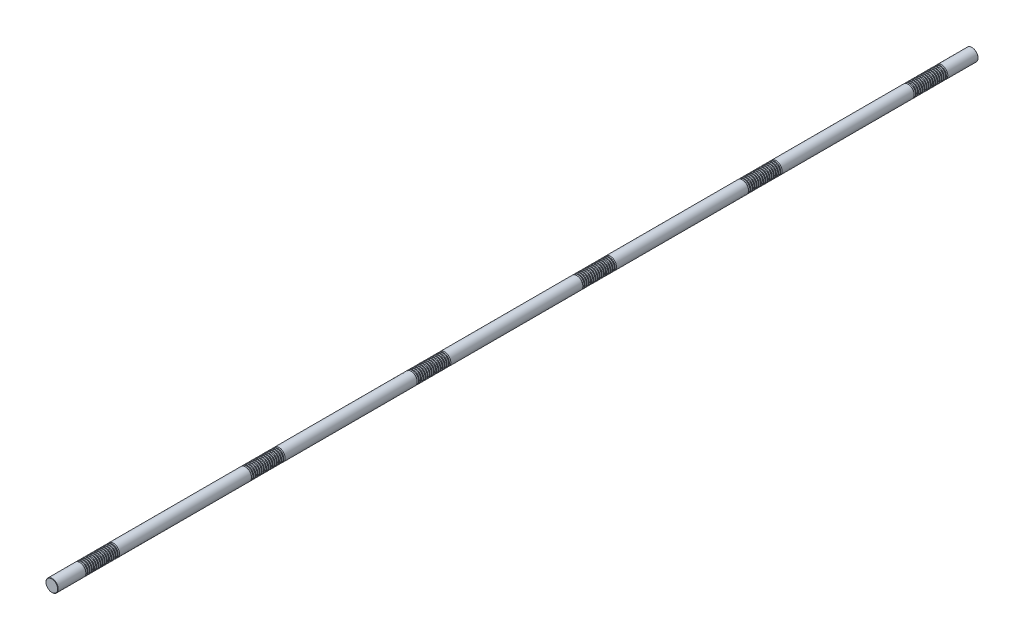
from build123d import *

# Parameters (mm, degrees)
SKETCH1_R           = 20
BOSS_EXTRUDE1_DEPTH = 1500
CHAMFER1_SIZE       = 1
LPATTERN1_COUNT     = 16
LPATTERN1_PITCH     = 7
LPATTERN2_COUNT     = 6
LPATTERN2_PITCH     = 540


with BuildPart() as part:
    # Sketch1 → Boss-Extrude1 (new, symmetric)
    with BuildSketch(Plane.XY):
        Circle(SKETCH1_R)
    extrude(amount=BOSS_EXTRUDE1_DEPTH, both=True)

    # Chamfer1
    chamfer1_edges = [part.edges().sort_by_distance(p)[0] for p in [
        (-20, 0, -1500),
        (-20, 0, 1500),
    ]]
    chamfer(chamfer1_edges, length=CHAMFER1_SIZE)

    # Sketch2 → Cut-Revolve1 (revolve, cut)
    with BuildSketch(Plane(origin=(0, 0, 0), x_dir=(0, 0, -1), z_dir=(1, 0, 0)), mode=Mode.PRIVATE) as cut_revolve1_sk:
        Polygon((1400.535898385, 20), (1395.964101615, 20), (1397.035898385, 16), (1399.464101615, 16), align=None)
    cut_revolve1 = revolve(cut_revolve1_sk.sketch.rotate(Axis((0, 0, 1500), (0, 0, -1)), 90), axis=Axis((0, 0, 1500), (0, 0, -1)), mode=Mode.SUBTRACT)

    # LPattern1: Cut-Revolve1 ×16
    with Locations(*[(0, 0, i * LPATTERN1_PITCH) for i in range(1, LPATTERN1_COUNT)]):
        add(cut_revolve1, mode=Mode.SUBTRACT)

    # LPattern2: Cut-Revolve1 ×6
    with Locations(*[(0, 0, i * LPATTERN2_PITCH) for i in range(1, LPATTERN2_COUNT)]):
        add(cut_revolve1, mode=Mode.SUBTRACT)

    # LPattern2 copy 1 sketch → LPattern2 copy 1 (revolve, cut)
    with BuildSketch(Plane(origin=(0, 0, 547), x_dir=(0, 0, -1), z_dir=(1, 0, 0))):
        Polygon((1400.535898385, 20), (1395.964101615, 20), (1397.035898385, 16), (1399.464101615, 16), align=None)
    revolve(axis=Axis((0, 0, 2047), (0, 0, -1)), mode=Mode.SUBTRACT)

    # LPattern2 copy 2 sketch → LPattern2 copy 2 (revolve, cut)
    with BuildSketch(Plane(origin=(0, 0, 1087), x_dir=(0, 0, -1), z_dir=(1, 0, 0))):
        Polygon((1400.535898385, 20), (1395.964101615, 20), (1397.035898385, 16), (1399.464101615, 16), align=None)
    revolve(axis=Axis((0, 0, 2587), (0, 0, -1)), mode=Mode.SUBTRACT)

    # LPattern2 copy 3 sketch → LPattern2 copy 3 (revolve, cut)
    with BuildSketch(Plane(origin=(0, 0, 1627), x_dir=(0, 0, -1), z_dir=(1, 0, 0))):
        Polygon((1400.535898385, 20), (1395.964101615, 20), (1397.035898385, 16), (1399.464101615, 16), align=None)
    revolve(axis=Axis((0, 0, 3127), (0, 0, -1)), mode=Mode.SUBTRACT)

    # LPattern2 copy 4 sketch → LPattern2 copy 4 (revolve, cut)
    with BuildSketch(Plane(origin=(0, 0, 2167), x_dir=(0, 0, -1), z_dir=(1, 0, 0))):
        Polygon((1400.535898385, 20), (1395.964101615, 20), (1397.035898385, 16), (1399.464101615, 16), align=None)
    revolve(axis=Axis((0, 0, 3667), (0, 0, -1)), mode=Mode.SUBTRACT)

    # LPattern2 copy 5 sketch → LPattern2 copy 5 (revolve, cut)
    with BuildSketch(Plane(origin=(0, 0, 2707), x_dir=(0, 0, -1), z_dir=(1, 0, 0))):
        Polygon((1400.535898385, 20), (1395.964101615, 20), (1397.035898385, 16), (1399.464101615, 16), align=None)
    revolve(axis=Axis((0, 0, 4207), (0, 0, -1)), mode=Mode.SUBTRACT)

    # LPattern2 copy 6 sketch → LPattern2 copy 6 (revolve, cut)
    with BuildSketch(Plane(origin=(0, 0, 554), x_dir=(0, 0, -1), z_dir=(1, 0, 0))):
        Polygon((1400.535898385, 20), (1395.964101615, 20), (1397.035898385, 16), (1399.464101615, 16), align=None)
    revolve(axis=Axis((0, 0, 2054), (0, 0, -1)), mode=Mode.SUBTRACT)

    # LPattern2 copy 7 sketch → LPattern2 copy 7 (revolve, cut)
    with BuildSketch(Plane(origin=(0, 0, 1094), x_dir=(0, 0, -1), z_dir=(1, 0, 0))):
        Polygon((1400.535898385, 20), (1395.964101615, 20), (1397.035898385, 16), (1399.464101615, 16), align=None)
    revolve(axis=Axis((0, 0, 2594), (0, 0, -1)), mode=Mode.SUBTRACT)

    # LPattern2 copy 8 sketch → LPattern2 copy 8 (revolve, cut)
    with BuildSketch(Plane(origin=(0, 0, 1634), x_dir=(0, 0, -1), z_dir=(1, 0, 0))):
        Polygon((1400.535898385, 20), (1395.964101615, 20), (1397.035898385, 16), (1399.464101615, 16), align=None)
    revolve(axis=Axis((0, 0, 3134), (0, 0, -1)), mode=Mode.SUBTRACT)

    # LPattern2 copy 9 sketch → LPattern2 copy 9 (revolve, cut)
    with BuildSketch(Plane(origin=(0, 0, 2174), x_dir=(0, 0, -1), z_dir=(1, 0, 0))):
        Polygon((1400.535898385, 20), (1395.964101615, 20), (1397.035898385, 16), (1399.464101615, 16), align=None)
    revolve(axis=Axis((0, 0, 3674), (0, 0, -1)), mode=Mode.SUBTRACT)

    # LPattern2 copy 10 sketch → LPattern2 copy 10 (revolve, cut)
    with BuildSketch(Plane(origin=(0, 0, 2714), x_dir=(0, 0, -1), z_dir=(1, 0, 0))):
        Polygon((1400.535898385, 20), (1395.964101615, 20), (1397.035898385, 16), (1399.464101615, 16), align=None)
    revolve(axis=Axis((0, 0, 4214), (0, 0, -1)), mode=Mode.SUBTRACT)

    # LPattern2 copy 11 sketch → LPattern2 copy 11 (revolve, cut)
    with BuildSketch(Plane(origin=(0, 0, 561), x_dir=(0, 0, -1), z_dir=(1, 0, 0))):
        Polygon((1400.535898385, 20), (1395.964101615, 20), (1397.035898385, 16), (1399.464101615, 16), align=None)
    revolve(axis=Axis((0, 0, 2061), (0, 0, -1)), mode=Mode.SUBTRACT)

    # LPattern2 copy 12 sketch → LPattern2 copy 12 (revolve, cut)
    with BuildSketch(Plane(origin=(0, 0, 1101), x_dir=(0, 0, -1), z_dir=(1, 0, 0))):
        Polygon((1400.535898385, 20), (1395.964101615, 20), (1397.035898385, 16), (1399.464101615, 16), align=None)
    revolve(axis=Axis((0, 0, 2601), (0, 0, -1)), mode=Mode.SUBTRACT)

    # LPattern2 copy 13 sketch → LPattern2 copy 13 (revolve, cut)
    with BuildSketch(Plane(origin=(0, 0, 1641), x_dir=(0, 0, -1), z_dir=(1, 0, 0))):
        Polygon((1400.535898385, 20), (1395.964101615, 20), (1397.035898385, 16), (1399.464101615, 16), align=None)
    revolve(axis=Axis((0, 0, 3141), (0, 0, -1)), mode=Mode.SUBTRACT)

    # LPattern2 copy 14 sketch → LPattern2 copy 14 (revolve, cut)
    with BuildSketch(Plane(origin=(0, 0, 2181), x_dir=(0, 0, -1), z_dir=(1, 0, 0))):
        Polygon((1400.535898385, 20), (1395.964101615, 20), (1397.035898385, 16), (1399.464101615, 16), align=None)
    revolve(axis=Axis((0, 0, 3681), (0, 0, -1)), mode=Mode.SUBTRACT)

    # LPattern2 copy 15 sketch → LPattern2 copy 15 (revolve, cut)
    with BuildSketch(Plane(origin=(0, 0, 2721), x_dir=(0, 0, -1), z_dir=(1, 0, 0))):
        Polygon((1400.535898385, 20), (1395.964101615, 20), (1397.035898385, 16), (1399.464101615, 16), align=None)
    revolve(axis=Axis((0, 0, 4221), (0, 0, -1)), mode=Mode.SUBTRACT)

    # LPattern2 copy 16 sketch → LPattern2 copy 16 (revolve, cut)
    with BuildSketch(Plane(origin=(0, 0, 568), x_dir=(0, 0, -1), z_dir=(1, 0, 0))):
        Polygon((1400.535898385, 20), (1395.964101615, 20), (1397.035898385, 16), (1399.464101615, 16), align=None)
    revolve(axis=Axis((0, 0, 2068), (0, 0, -1)), mode=Mode.SUBTRACT)

    # LPattern2 copy 17 sketch → LPattern2 copy 17 (revolve, cut)
    with BuildSketch(Plane(origin=(0, 0, 1108), x_dir=(0, 0, -1), z_dir=(1, 0, 0))):
        Polygon((1400.535898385, 20), (1395.964101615, 20), (1397.035898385, 16), (1399.464101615, 16), align=None)
    revolve(axis=Axis((0, 0, 2608), (0, 0, -1)), mode=Mode.SUBTRACT)

    # LPattern2 copy 18 sketch → LPattern2 copy 18 (revolve, cut)
    with BuildSketch(Plane(origin=(0, 0, 1648), x_dir=(0, 0, -1), z_dir=(1, 0, 0))):
        Polygon((1400.535898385, 20), (1395.964101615, 20), (1397.035898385, 16), (1399.464101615, 16), align=None)
    revolve(axis=Axis((0, 0, 3148), (0, 0, -1)), mode=Mode.SUBTRACT)

    # LPattern2 copy 19 sketch → LPattern2 copy 19 (revolve, cut)
    with BuildSketch(Plane(origin=(0, 0, 2188), x_dir=(0, 0, -1), z_dir=(1, 0, 0))):
        Polygon((1400.535898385, 20), (1395.964101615, 20), (1397.035898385, 16), (1399.464101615, 16), align=None)
    revolve(axis=Axis((0, 0, 3688), (0, 0, -1)), mode=Mode.SUBTRACT)

    # LPattern2 copy 20 sketch → LPattern2 copy 20 (revolve, cut)
    with BuildSketch(Plane(origin=(0, 0, 2728), x_dir=(0, 0, -1), z_dir=(1, 0, 0))):
        Polygon((1400.535898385, 20), (1395.964101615, 20), (1397.035898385, 16), (1399.464101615, 16), align=None)
    revolve(axis=Axis((0, 0, 4228), (0, 0, -1)), mode=Mode.SUBTRACT)

    # LPattern2 copy 21 sketch → LPattern2 copy 21 (revolve, cut)
    with BuildSketch(Plane(origin=(0, 0, 575), x_dir=(0, 0, -1), z_dir=(1, 0, 0))):
        Polygon((1400.535898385, 20), (1395.964101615, 20), (1397.035898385, 16), (1399.464101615, 16), align=None)
    revolve(axis=Axis((0, 0, 2075), (0, 0, -1)), mode=Mode.SUBTRACT)

    # LPattern2 copy 22 sketch → LPattern2 copy 22 (revolve, cut)
    with BuildSketch(Plane(origin=(0, 0, 1115), x_dir=(0, 0, -1), z_dir=(1, 0, 0))):
        Polygon((1400.535898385, 20), (1395.964101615, 20), (1397.035898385, 16), (1399.464101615, 16), align=None)
    revolve(axis=Axis((0, 0, 2615), (0, 0, -1)), mode=Mode.SUBTRACT)

    # LPattern2 copy 23 sketch → LPattern2 copy 23 (revolve, cut)
    with BuildSketch(Plane(origin=(0, 0, 1655), x_dir=(0, 0, -1), z_dir=(1, 0, 0))):
        Polygon((1400.535898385, 20), (1395.964101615, 20), (1397.035898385, 16), (1399.464101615, 16), align=None)
    revolve(axis=Axis((0, 0, 3155), (0, 0, -1)), mode=Mode.SUBTRACT)

    # LPattern2 copy 24 sketch → LPattern2 copy 24 (revolve, cut)
    with BuildSketch(Plane(origin=(0, 0, 2195), x_dir=(0, 0, -1), z_dir=(1, 0, 0))):
        Polygon((1400.535898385, 20), (1395.964101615, 20), (1397.035898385, 16), (1399.464101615, 16), align=None)
    revolve(axis=Axis((0, 0, 3695), (0, 0, -1)), mode=Mode.SUBTRACT)

    # LPattern2 copy 25 sketch → LPattern2 copy 25 (revolve, cut)
    with BuildSketch(Plane(origin=(0, 0, 2735), x_dir=(0, 0, -1), z_dir=(1, 0, 0))):
        Polygon((1400.535898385, 20), (1395.964101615, 20), (1397.035898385, 16), (1399.464101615, 16), align=None)
    revolve(axis=Axis((0, 0, 4235), (0, 0, -1)), mode=Mode.SUBTRACT)

    # LPattern2 copy 26 sketch → LPattern2 copy 26 (revolve, cut)
    with BuildSketch(Plane(origin=(0, 0, 582), x_dir=(0, 0, -1), z_dir=(1, 0, 0))):
        Polygon((1400.535898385, 20), (1395.964101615, 20), (1397.035898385, 16), (1399.464101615, 16), align=None)
    revolve(axis=Axis((0, 0, 2082), (0, 0, -1)), mode=Mode.SUBTRACT)

    # LPattern2 copy 27 sketch → LPattern2 copy 27 (revolve, cut)
    with BuildSketch(Plane(origin=(0, 0, 1122), x_dir=(0, 0, -1), z_dir=(1, 0, 0))):
        Polygon((1400.535898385, 20), (1395.964101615, 20), (1397.035898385, 16), (1399.464101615, 16), align=None)
    revolve(axis=Axis((0, 0, 2622), (0, 0, -1)), mode=Mode.SUBTRACT)

    # LPattern2 copy 28 sketch → LPattern2 copy 28 (revolve, cut)
    with BuildSketch(Plane(origin=(0, 0, 1662), x_dir=(0, 0, -1), z_dir=(1, 0, 0))):
        Polygon((1400.535898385, 20), (1395.964101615, 20), (1397.035898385, 16), (1399.464101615, 16), align=None)
    revolve(axis=Axis((0, 0, 3162), (0, 0, -1)), mode=Mode.SUBTRACT)

    # LPattern2 copy 29 sketch → LPattern2 copy 29 (revolve, cut)
    with BuildSketch(Plane(origin=(0, 0, 2202), x_dir=(0, 0, -1), z_dir=(1, 0, 0))):
        Polygon((1400.535898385, 20), (1395.964101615, 20), (1397.035898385, 16), (1399.464101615, 16), align=None)
    revolve(axis=Axis((0, 0, 3702), (0, 0, -1)), mode=Mode.SUBTRACT)

    # LPattern2 copy 30 sketch → LPattern2 copy 30 (revolve, cut)
    with BuildSketch(Plane(origin=(0, 0, 2742), x_dir=(0, 0, -1), z_dir=(1, 0, 0))):
        Polygon((1400.535898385, 20), (1395.964101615, 20), (1397.035898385, 16), (1399.464101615, 16), align=None)
    revolve(axis=Axis((0, 0, 4242), (0, 0, -1)), mode=Mode.SUBTRACT)

    # LPattern2 copy 31 sketch → LPattern2 copy 31 (revolve, cut)
    with BuildSketch(Plane(origin=(0, 0, 589), x_dir=(0, 0, -1), z_dir=(1, 0, 0))):
        Polygon((1400.535898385, 20), (1395.964101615, 20), (1397.035898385, 16), (1399.464101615, 16), align=None)
    revolve(axis=Axis((0, 0, 2089), (0, 0, -1)), mode=Mode.SUBTRACT)

    # LPattern2 copy 32 sketch → LPattern2 copy 32 (revolve, cut)
    with BuildSketch(Plane(origin=(0, 0, 1129), x_dir=(0, 0, -1), z_dir=(1, 0, 0))):
        Polygon((1400.535898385, 20), (1395.964101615, 20), (1397.035898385, 16), (1399.464101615, 16), align=None)
    revolve(axis=Axis((0, 0, 2629), (0, 0, -1)), mode=Mode.SUBTRACT)

    # LPattern2 copy 33 sketch → LPattern2 copy 33 (revolve, cut)
    with BuildSketch(Plane(origin=(0, 0, 1669), x_dir=(0, 0, -1), z_dir=(1, 0, 0))):
        Polygon((1400.535898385, 20), (1395.964101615, 20), (1397.035898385, 16), (1399.464101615, 16), align=None)
    revolve(axis=Axis((0, 0, 3169), (0, 0, -1)), mode=Mode.SUBTRACT)

    # LPattern2 copy 34 sketch → LPattern2 copy 34 (revolve, cut)
    with BuildSketch(Plane(origin=(0, 0, 2209), x_dir=(0, 0, -1), z_dir=(1, 0, 0))):
        Polygon((1400.535898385, 20), (1395.964101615, 20), (1397.035898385, 16), (1399.464101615, 16), align=None)
    revolve(axis=Axis((0, 0, 3709), (0, 0, -1)), mode=Mode.SUBTRACT)

    # LPattern2 copy 35 sketch → LPattern2 copy 35 (revolve, cut)
    with BuildSketch(Plane(origin=(0, 0, 2749), x_dir=(0, 0, -1), z_dir=(1, 0, 0))):
        Polygon((1400.535898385, 20), (1395.964101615, 20), (1397.035898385, 16), (1399.464101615, 16), align=None)
    revolve(axis=Axis((0, 0, 4249), (0, 0, -1)), mode=Mode.SUBTRACT)

    # LPattern2 copy 36 sketch → LPattern2 copy 36 (revolve, cut)
    with BuildSketch(Plane(origin=(0, 0, 596), x_dir=(0, 0, -1), z_dir=(1, 0, 0))):
        Polygon((1400.535898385, 20), (1395.964101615, 20), (1397.035898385, 16), (1399.464101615, 16), align=None)
    revolve(axis=Axis((0, 0, 2096), (0, 0, -1)), mode=Mode.SUBTRACT)

    # LPattern2 copy 37 sketch → LPattern2 copy 37 (revolve, cut)
    with BuildSketch(Plane(origin=(0, 0, 1136), x_dir=(0, 0, -1), z_dir=(1, 0, 0))):
        Polygon((1400.535898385, 20), (1395.964101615, 20), (1397.035898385, 16), (1399.464101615, 16), align=None)
    revolve(axis=Axis((0, 0, 2636), (0, 0, -1)), mode=Mode.SUBTRACT)

    # LPattern2 copy 38 sketch → LPattern2 copy 38 (revolve, cut)
    with BuildSketch(Plane(origin=(0, 0, 1676), x_dir=(0, 0, -1), z_dir=(1, 0, 0))):
        Polygon((1400.535898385, 20), (1395.964101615, 20), (1397.035898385, 16), (1399.464101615, 16), align=None)
    revolve(axis=Axis((0, 0, 3176), (0, 0, -1)), mode=Mode.SUBTRACT)

    # LPattern2 copy 39 sketch → LPattern2 copy 39 (revolve, cut)
    with BuildSketch(Plane(origin=(0, 0, 2216), x_dir=(0, 0, -1), z_dir=(1, 0, 0))):
        Polygon((1400.535898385, 20), (1395.964101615, 20), (1397.035898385, 16), (1399.464101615, 16), align=None)
    revolve(axis=Axis((0, 0, 3716), (0, 0, -1)), mode=Mode.SUBTRACT)

    # LPattern2 copy 40 sketch → LPattern2 copy 40 (revolve, cut)
    with BuildSketch(Plane(origin=(0, 0, 2756), x_dir=(0, 0, -1), z_dir=(1, 0, 0))):
        Polygon((1400.535898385, 20), (1395.964101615, 20), (1397.035898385, 16), (1399.464101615, 16), align=None)
    revolve(axis=Axis((0, 0, 4256), (0, 0, -1)), mode=Mode.SUBTRACT)

    # LPattern2 copy 41 sketch → LPattern2 copy 41 (revolve, cut)
    with BuildSketch(Plane(origin=(0, 0, 603), x_dir=(0, 0, -1), z_dir=(1, 0, 0))):
        Polygon((1400.535898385, 20), (1395.964101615, 20), (1397.035898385, 16), (1399.464101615, 16), align=None)
    revolve(axis=Axis((0, 0, 2103), (0, 0, -1)), mode=Mode.SUBTRACT)

    # LPattern2 copy 42 sketch → LPattern2 copy 42 (revolve, cut)
    with BuildSketch(Plane(origin=(0, 0, 1143), x_dir=(0, 0, -1), z_dir=(1, 0, 0))):
        Polygon((1400.535898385, 20), (1395.964101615, 20), (1397.035898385, 16), (1399.464101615, 16), align=None)
    revolve(axis=Axis((0, 0, 2643), (0, 0, -1)), mode=Mode.SUBTRACT)

    # LPattern2 copy 43 sketch → LPattern2 copy 43 (revolve, cut)
    with BuildSketch(Plane(origin=(0, 0, 1683), x_dir=(0, 0, -1), z_dir=(1, 0, 0))):
        Polygon((1400.535898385, 20), (1395.964101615, 20), (1397.035898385, 16), (1399.464101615, 16), align=None)
    revolve(axis=Axis((0, 0, 3183), (0, 0, -1)), mode=Mode.SUBTRACT)

    # LPattern2 copy 44 sketch → LPattern2 copy 44 (revolve, cut)
    with BuildSketch(Plane(origin=(0, 0, 2223), x_dir=(0, 0, -1), z_dir=(1, 0, 0))):
        Polygon((1400.535898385, 20), (1395.964101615, 20), (1397.035898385, 16), (1399.464101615, 16), align=None)
    revolve(axis=Axis((0, 0, 3723), (0, 0, -1)), mode=Mode.SUBTRACT)

    # LPattern2 copy 45 sketch → LPattern2 copy 45 (revolve, cut)
    with BuildSketch(Plane(origin=(0, 0, 2763), x_dir=(0, 0, -1), z_dir=(1, 0, 0))):
        Polygon((1400.535898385, 20), (1395.964101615, 20), (1397.035898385, 16), (1399.464101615, 16), align=None)
    revolve(axis=Axis((0, 0, 4263), (0, 0, -1)), mode=Mode.SUBTRACT)

    # LPattern2 copy 46 sketch → LPattern2 copy 46 (revolve, cut)
    with BuildSketch(Plane(origin=(0, 0, 610), x_dir=(0, 0, -1), z_dir=(1, 0, 0))):
        Polygon((1400.535898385, 20), (1395.964101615, 20), (1397.035898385, 16), (1399.464101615, 16), align=None)
    revolve(axis=Axis((0, 0, 2110), (0, 0, -1)), mode=Mode.SUBTRACT)

    # LPattern2 copy 47 sketch → LPattern2 copy 47 (revolve, cut)
    with BuildSketch(Plane(origin=(0, 0, 1150), x_dir=(0, 0, -1), z_dir=(1, 0, 0))):
        Polygon((1400.535898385, 20), (1395.964101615, 20), (1397.035898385, 16), (1399.464101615, 16), align=None)
    revolve(axis=Axis((0, 0, 2650), (0, 0, -1)), mode=Mode.SUBTRACT)

    # LPattern2 copy 48 sketch → LPattern2 copy 48 (revolve, cut)
    with BuildSketch(Plane(origin=(0, 0, 1690), x_dir=(0, 0, -1), z_dir=(1, 0, 0))):
        Polygon((1400.535898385, 20), (1395.964101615, 20), (1397.035898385, 16), (1399.464101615, 16), align=None)
    revolve(axis=Axis((0, 0, 3190), (0, 0, -1)), mode=Mode.SUBTRACT)

    # LPattern2 copy 49 sketch → LPattern2 copy 49 (revolve, cut)
    with BuildSketch(Plane(origin=(0, 0, 2230), x_dir=(0, 0, -1), z_dir=(1, 0, 0))):
        Polygon((1400.535898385, 20), (1395.964101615, 20), (1397.035898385, 16), (1399.464101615, 16), align=None)
    revolve(axis=Axis((0, 0, 3730), (0, 0, -1)), mode=Mode.SUBTRACT)

    # LPattern2 copy 50 sketch → LPattern2 copy 50 (revolve, cut)
    with BuildSketch(Plane(origin=(0, 0, 2770), x_dir=(0, 0, -1), z_dir=(1, 0, 0))):
        Polygon((1400.535898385, 20), (1395.964101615, 20), (1397.035898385, 16), (1399.464101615, 16), align=None)
    revolve(axis=Axis((0, 0, 4270), (0, 0, -1)), mode=Mode.SUBTRACT)

    # LPattern2 copy 51 sketch → LPattern2 copy 51 (revolve, cut)
    with BuildSketch(Plane(origin=(0, 0, 617), x_dir=(0, 0, -1), z_dir=(1, 0, 0))):
        Polygon((1400.535898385, 20), (1395.964101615, 20), (1397.035898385, 16), (1399.464101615, 16), align=None)
    revolve(axis=Axis((0, 0, 2117), (0, 0, -1)), mode=Mode.SUBTRACT)

    # LPattern2 copy 52 sketch → LPattern2 copy 52 (revolve, cut)
    with BuildSketch(Plane(origin=(0, 0, 1157), x_dir=(0, 0, -1), z_dir=(1, 0, 0))):
        Polygon((1400.535898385, 20), (1395.964101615, 20), (1397.035898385, 16), (1399.464101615, 16), align=None)
    revolve(axis=Axis((0, 0, 2657), (0, 0, -1)), mode=Mode.SUBTRACT)

    # LPattern2 copy 53 sketch → LPattern2 copy 53 (revolve, cut)
    with BuildSketch(Plane(origin=(0, 0, 1697), x_dir=(0, 0, -1), z_dir=(1, 0, 0))):
        Polygon((1400.535898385, 20), (1395.964101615, 20), (1397.035898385, 16), (1399.464101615, 16), align=None)
    revolve(axis=Axis((0, 0, 3197), (0, 0, -1)), mode=Mode.SUBTRACT)

    # LPattern2 copy 54 sketch → LPattern2 copy 54 (revolve, cut)
    with BuildSketch(Plane(origin=(0, 0, 2237), x_dir=(0, 0, -1), z_dir=(1, 0, 0))):
        Polygon((1400.535898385, 20), (1395.964101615, 20), (1397.035898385, 16), (1399.464101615, 16), align=None)
    revolve(axis=Axis((0, 0, 3737), (0, 0, -1)), mode=Mode.SUBTRACT)

    # LPattern2 copy 55 sketch → LPattern2 copy 55 (revolve, cut)
    with BuildSketch(Plane(origin=(0, 0, 2777), x_dir=(0, 0, -1), z_dir=(1, 0, 0))):
        Polygon((1400.535898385, 20), (1395.964101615, 20), (1397.035898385, 16), (1399.464101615, 16), align=None)
    revolve(axis=Axis((0, 0, 4277), (0, 0, -1)), mode=Mode.SUBTRACT)

    # LPattern2 copy 56 sketch → LPattern2 copy 56 (revolve, cut)
    with BuildSketch(Plane(origin=(0, 0, 624), x_dir=(0, 0, -1), z_dir=(1, 0, 0))):
        Polygon((1400.535898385, 20), (1395.964101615, 20), (1397.035898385, 16), (1399.464101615, 16), align=None)
    revolve(axis=Axis((0, 0, 2124), (0, 0, -1)), mode=Mode.SUBTRACT)

    # LPattern2 copy 57 sketch → LPattern2 copy 57 (revolve, cut)
    with BuildSketch(Plane(origin=(0, 0, 1164), x_dir=(0, 0, -1), z_dir=(1, 0, 0))):
        Polygon((1400.535898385, 20), (1395.964101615, 20), (1397.035898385, 16), (1399.464101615, 16), align=None)
    revolve(axis=Axis((0, 0, 2664), (0, 0, -1)), mode=Mode.SUBTRACT)

    # LPattern2 copy 58 sketch → LPattern2 copy 58 (revolve, cut)
    with BuildSketch(Plane(origin=(0, 0, 1704), x_dir=(0, 0, -1), z_dir=(1, 0, 0))):
        Polygon((1400.535898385, 20), (1395.964101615, 20), (1397.035898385, 16), (1399.464101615, 16), align=None)
    revolve(axis=Axis((0, 0, 3204), (0, 0, -1)), mode=Mode.SUBTRACT)

    # LPattern2 copy 59 sketch → LPattern2 copy 59 (revolve, cut)
    with BuildSketch(Plane(origin=(0, 0, 2244), x_dir=(0, 0, -1), z_dir=(1, 0, 0))):
        Polygon((1400.535898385, 20), (1395.964101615, 20), (1397.035898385, 16), (1399.464101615, 16), align=None)
    revolve(axis=Axis((0, 0, 3744), (0, 0, -1)), mode=Mode.SUBTRACT)

    # LPattern2 copy 60 sketch → LPattern2 copy 60 (revolve, cut)
    with BuildSketch(Plane(origin=(0, 0, 2784), x_dir=(0, 0, -1), z_dir=(1, 0, 0))):
        Polygon((1400.535898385, 20), (1395.964101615, 20), (1397.035898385, 16), (1399.464101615, 16), align=None)
    revolve(axis=Axis((0, 0, 4284), (0, 0, -1)), mode=Mode.SUBTRACT)

    # LPattern2 copy 61 sketch → LPattern2 copy 61 (revolve, cut)
    with BuildSketch(Plane(origin=(0, 0, 631), x_dir=(0, 0, -1), z_dir=(1, 0, 0))):
        Polygon((1400.535898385, 20), (1395.964101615, 20), (1397.035898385, 16), (1399.464101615, 16), align=None)
    revolve(axis=Axis((0, 0, 2131), (0, 0, -1)), mode=Mode.SUBTRACT)

    # LPattern2 copy 62 sketch → LPattern2 copy 62 (revolve, cut)
    with BuildSketch(Plane(origin=(0, 0, 1171), x_dir=(0, 0, -1), z_dir=(1, 0, 0))):
        Polygon((1400.535898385, 20), (1395.964101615, 20), (1397.035898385, 16), (1399.464101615, 16), align=None)
    revolve(axis=Axis((0, 0, 2671), (0, 0, -1)), mode=Mode.SUBTRACT)

    # LPattern2 copy 63 sketch → LPattern2 copy 63 (revolve, cut)
    with BuildSketch(Plane(origin=(0, 0, 1711), x_dir=(0, 0, -1), z_dir=(1, 0, 0))):
        Polygon((1400.535898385, 20), (1395.964101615, 20), (1397.035898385, 16), (1399.464101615, 16), align=None)
    revolve(axis=Axis((0, 0, 3211), (0, 0, -1)), mode=Mode.SUBTRACT)

    # LPattern2 copy 64 sketch → LPattern2 copy 64 (revolve, cut)
    with BuildSketch(Plane(origin=(0, 0, 2251), x_dir=(0, 0, -1), z_dir=(1, 0, 0))):
        Polygon((1400.535898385, 20), (1395.964101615, 20), (1397.035898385, 16), (1399.464101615, 16), align=None)
    revolve(axis=Axis((0, 0, 3751), (0, 0, -1)), mode=Mode.SUBTRACT)

    # LPattern2 copy 65 sketch → LPattern2 copy 65 (revolve, cut)
    with BuildSketch(Plane(origin=(0, 0, 2791), x_dir=(0, 0, -1), z_dir=(1, 0, 0))):
        Polygon((1400.535898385, 20), (1395.964101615, 20), (1397.035898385, 16), (1399.464101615, 16), align=None)
    revolve(axis=Axis((0, 0, 4291), (0, 0, -1)), mode=Mode.SUBTRACT)

    # LPattern2 copy 66 sketch → LPattern2 copy 66 (revolve, cut)
    with BuildSketch(Plane(origin=(0, 0, 638), x_dir=(0, 0, -1), z_dir=(1, 0, 0))):
        Polygon((1400.535898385, 20), (1395.964101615, 20), (1397.035898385, 16), (1399.464101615, 16), align=None)
    revolve(axis=Axis((0, 0, 2138), (0, 0, -1)), mode=Mode.SUBTRACT)

    # LPattern2 copy 67 sketch → LPattern2 copy 67 (revolve, cut)
    with BuildSketch(Plane(origin=(0, 0, 1178), x_dir=(0, 0, -1), z_dir=(1, 0, 0))):
        Polygon((1400.535898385, 20), (1395.964101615, 20), (1397.035898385, 16), (1399.464101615, 16), align=None)
    revolve(axis=Axis((0, 0, 2678), (0, 0, -1)), mode=Mode.SUBTRACT)

    # LPattern2 copy 68 sketch → LPattern2 copy 68 (revolve, cut)
    with BuildSketch(Plane(origin=(0, 0, 1718), x_dir=(0, 0, -1), z_dir=(1, 0, 0))):
        Polygon((1400.535898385, 20), (1395.964101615, 20), (1397.035898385, 16), (1399.464101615, 16), align=None)
    revolve(axis=Axis((0, 0, 3218), (0, 0, -1)), mode=Mode.SUBTRACT)

    # LPattern2 copy 69 sketch → LPattern2 copy 69 (revolve, cut)
    with BuildSketch(Plane(origin=(0, 0, 2258), x_dir=(0, 0, -1), z_dir=(1, 0, 0))):
        Polygon((1400.535898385, 20), (1395.964101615, 20), (1397.035898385, 16), (1399.464101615, 16), align=None)
    revolve(axis=Axis((0, 0, 3758), (0, 0, -1)), mode=Mode.SUBTRACT)

    # LPattern2 copy 70 sketch → LPattern2 copy 70 (revolve, cut)
    with BuildSketch(Plane(origin=(0, 0, 2798), x_dir=(0, 0, -1), z_dir=(1, 0, 0))):
        Polygon((1400.535898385, 20), (1395.964101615, 20), (1397.035898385, 16), (1399.464101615, 16), align=None)
    revolve(axis=Axis((0, 0, 4298), (0, 0, -1)), mode=Mode.SUBTRACT)

    # LPattern2 copy 71 sketch → LPattern2 copy 71 (revolve, cut)
    with BuildSketch(Plane(origin=(0, 0, 645), x_dir=(0, 0, -1), z_dir=(1, 0, 0))):
        Polygon((1400.535898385, 20), (1395.964101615, 20), (1397.035898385, 16), (1399.464101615, 16), align=None)
    revolve(axis=Axis((0, 0, 2145), (0, 0, -1)), mode=Mode.SUBTRACT)

    # LPattern2 copy 72 sketch → LPattern2 copy 72 (revolve, cut)
    with BuildSketch(Plane(origin=(0, 0, 1185), x_dir=(0, 0, -1), z_dir=(1, 0, 0))):
        Polygon((1400.535898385, 20), (1395.964101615, 20), (1397.035898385, 16), (1399.464101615, 16), align=None)
    revolve(axis=Axis((0, 0, 2685), (0, 0, -1)), mode=Mode.SUBTRACT)

    # LPattern2 copy 73 sketch → LPattern2 copy 73 (revolve, cut)
    with BuildSketch(Plane(origin=(0, 0, 1725), x_dir=(0, 0, -1), z_dir=(1, 0, 0))):
        Polygon((1400.535898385, 20), (1395.964101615, 20), (1397.035898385, 16), (1399.464101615, 16), align=None)
    revolve(axis=Axis((0, 0, 3225), (0, 0, -1)), mode=Mode.SUBTRACT)

    # LPattern2 copy 74 sketch → LPattern2 copy 74 (revolve, cut)
    with BuildSketch(Plane(origin=(0, 0, 2265), x_dir=(0, 0, -1), z_dir=(1, 0, 0))):
        Polygon((1400.535898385, 20), (1395.964101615, 20), (1397.035898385, 16), (1399.464101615, 16), align=None)
    revolve(axis=Axis((0, 0, 3765), (0, 0, -1)), mode=Mode.SUBTRACT)

    # LPattern2 copy 75 sketch → LPattern2 copy 75 (revolve, cut)
    with BuildSketch(Plane(origin=(0, 0, 2805), x_dir=(0, 0, -1), z_dir=(1, 0, 0))):
        Polygon((1400.535898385, 20), (1395.964101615, 20), (1397.035898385, 16), (1399.464101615, 16), align=None)
    revolve(axis=Axis((0, 0, 4305), (0, 0, -1)), mode=Mode.SUBTRACT)


solid = part.part
